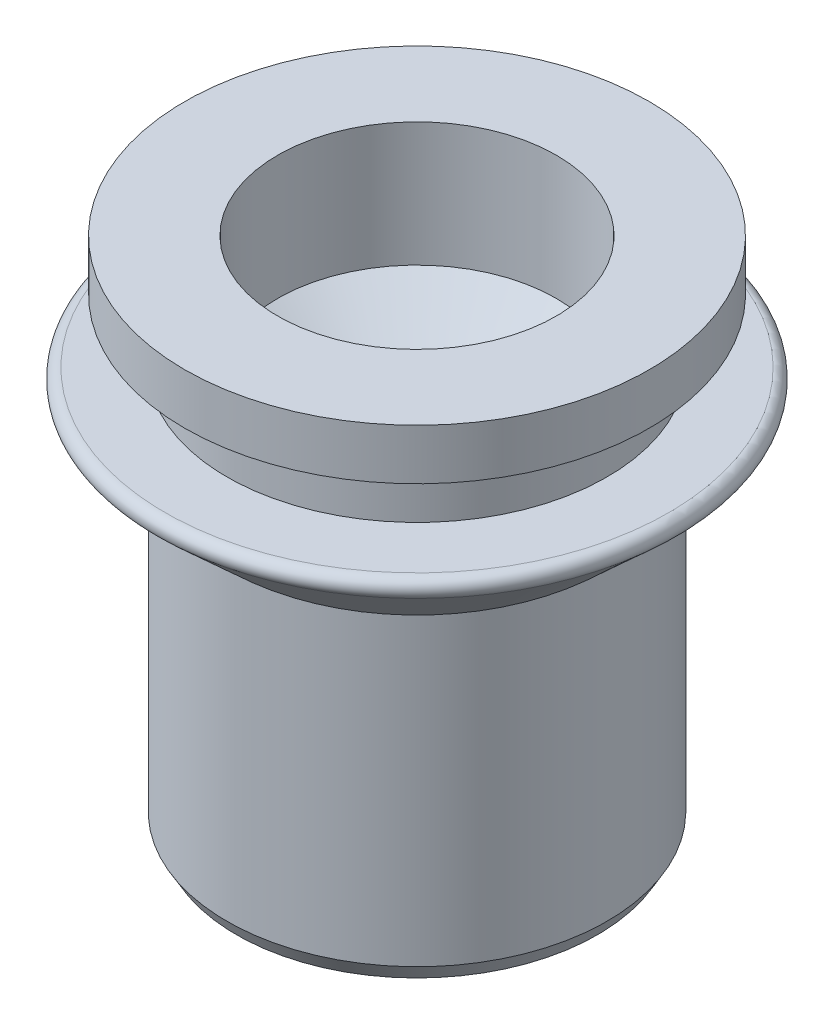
ISO-10303-21;
HEADER;
FILE_DESCRIPTION(('STEP AP214'),'2;1');
FILE_NAME('part.step','',(''),(''),'','','');
FILE_SCHEMA(('AUTOMOTIVE_DESIGN { 1 0 10303 214 1 1 1 1 }'));
ENDSEC;
DATA;
#1=APPLICATION_CONTEXT('core data for automotive mechanical design processes');
#2=APPLICATION_PROTOCOL_DEFINITION('international standard','automotive_design',2000,#1);
#3=PRODUCT_CONTEXT('',#1,'mechanical');
#4=PRODUCT('Part','Part','',(#3));
#5=PRODUCT_RELATED_PRODUCT_CATEGORY('part','',(#4));
#6=PRODUCT_DEFINITION_FORMATION('','',#4);
#7=PRODUCT_DEFINITION_CONTEXT('part definition',#1,'design');
#8=PRODUCT_DEFINITION('design','',#6,#7);
#9=PRODUCT_DEFINITION_SHAPE('','',#8);
#10=(LENGTH_UNIT() NAMED_UNIT(*) SI_UNIT(.MILLI.,.METRE.));
#11=(NAMED_UNIT(*) PLANE_ANGLE_UNIT() SI_UNIT($,.RADIAN.));
#12=(NAMED_UNIT(*) SI_UNIT($,.STERADIAN.) SOLID_ANGLE_UNIT());
#13=UNCERTAINTY_MEASURE_WITH_UNIT(LENGTH_MEASURE(1.E-05),#10,'distance_accuracy_value','');
#14=(GEOMETRIC_REPRESENTATION_CONTEXT(3) GLOBAL_UNCERTAINTY_ASSIGNED_CONTEXT((#13)) GLOBAL_UNIT_ASSIGNED_CONTEXT((#10,
#11,#12)) REPRESENTATION_CONTEXT('',''));
#15=CARTESIAN_POINT('',(0.,0.,0.));
#16=DIRECTION('',(0.,0.,1.));
#17=DIRECTION('',(1.,0.,0.));
#18=AXIS2_PLACEMENT_3D('',#15,#16,#17);
#19=CARTESIAN_POINT('',(0.,12.2,0.));
#20=DIRECTION('',(0.,-1.,0.));
#21=DIRECTION('',(0.,0.,-1.));
#22=AXIS2_PLACEMENT_3D('',#19,#20,#21);
#23=PLANE('',#22);
#24=CARTESIAN_POINT('',(0.,12.2,0.));
#25=DIRECTION('',(0.,-1.,0.));
#26=DIRECTION('',(0.,0.,-1.));
#27=AXIS2_PLACEMENT_3D('',#24,#25,#26);
#28=CIRCLE('',#27,5.5);
#29=CARTESIAN_POINT('',(0.,12.2,-5.49999999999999));
#30=VERTEX_POINT('',#29);
#31=EDGE_CURVE('E73',#30,#30,#28,.T.);
#32=ORIENTED_EDGE('',*,*,#31,.F.);
#33=EDGE_LOOP('',(#32));
#34=FACE_BOUND('',#33,.T.);
#35=CARTESIAN_POINT('',(0.,12.2,0.));
#36=DIRECTION('',(0.,-1.,0.));
#37=DIRECTION('',(0.,0.,-1.));
#38=AXIS2_PLACEMENT_3D('',#35,#36,#37);
#39=CIRCLE('',#38,3.3);
#40=CARTESIAN_POINT('',(0.,12.2,-3.29999999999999));
#41=VERTEX_POINT('',#40);
#42=EDGE_CURVE('E26',#41,#41,#39,.F.);
#43=ORIENTED_EDGE('',*,*,#42,.F.);
#44=EDGE_LOOP('',(#43));
#45=FACE_BOUND('',#44,.T.);
#46=ADVANCED_FACE('F22',(#34,#45),#23,.F.);
#47=CARTESIAN_POINT('',(0.,-0.999999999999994,0.));
#48=DIRECTION('',(0.,-1.,0.));
#49=DIRECTION('',(0.,0.,1.));
#50=AXIS2_PLACEMENT_3D('',#47,#48,#49);
#51=CYLINDRICAL_SURFACE('',#50,2.45875);
#52=CARTESIAN_POINT('',(0.,0.541250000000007,0.));
#53=DIRECTION('',(0.,-1.,0.));
#54=DIRECTION('',(0.,0.,1.));
#55=AXIS2_PLACEMENT_3D('',#52,#53,#54);
#56=CIRCLE('',#55,2.45875);
#57=CARTESIAN_POINT('',(0.,0.541250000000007,2.45875000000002));
#58=VERTEX_POINT('',#57);
#59=EDGE_CURVE('E70',#58,#58,#56,.T.);
#60=ORIENTED_EDGE('',*,*,#59,.T.);
#61=EDGE_LOOP('',(#60));
#62=FACE_BOUND('',#61,.T.);
#63=CARTESIAN_POINT('',(0.,6.85553820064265,0.));
#64=DIRECTION('',(0.,1.,0.));
#65=DIRECTION('',(0.,0.,1.));
#66=AXIS2_PLACEMENT_3D('',#63,#64,#65);
#67=CIRCLE('',#66,2.45875);
#68=CARTESIAN_POINT('',(0.,6.85553820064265,2.45875000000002));
#69=VERTEX_POINT('',#68);
#70=EDGE_CURVE('E44',#69,#69,#67,.T.);
#71=ORIENTED_EDGE('',*,*,#70,.T.);
#72=EDGE_LOOP('',(#71));
#73=FACE_BOUND('',#72,.T.);
#74=ADVANCED_FACE('F124',(#62,#73),#51,.F.);
#75=CARTESIAN_POINT('',(0.,0.,0.));
#76=DIRECTION('',(0.,-1.,0.));
#77=DIRECTION('',(0.,0.,-1.));
#78=AXIS2_PLACEMENT_3D('',#75,#76,#77);
#79=PLANE('',#78);
#80=CARTESIAN_POINT('',(0.,0.,0.));
#81=DIRECTION('',(0.,-1.,0.));
#82=DIRECTION('',(0.,0.,-1.));
#83=AXIS2_PLACEMENT_3D('',#80,#81,#82);
#84=CIRCLE('',#83,4.275);
#85=CARTESIAN_POINT('',(0.,0.,-4.275));
#86=VERTEX_POINT('',#85);
#87=EDGE_CURVE('E12',#86,#86,#84,.T.);
#88=ORIENTED_EDGE('',*,*,#87,.T.);
#89=EDGE_LOOP('',(#88));
#90=FACE_BOUND('',#89,.T.);
#91=CARTESIAN_POINT('',(0.,0.,0.));
#92=DIRECTION('',(0.,-1.,0.));
#93=DIRECTION('',(0.,0.,1.));
#94=AXIS2_PLACEMENT_3D('',#91,#92,#93);
#95=CIRCLE('',#94,3.);
#96=CARTESIAN_POINT('',(0.,0.,3.));
#97=VERTEX_POINT('',#96);
#98=EDGE_CURVE('E54',#97,#97,#95,.T.);
#99=ORIENTED_EDGE('',*,*,#98,.F.);
#100=EDGE_LOOP('',(#99));
#101=FACE_BOUND('',#100,.T.);
#102=ADVANCED_FACE('F24',(#90,#101),#79,.T.);
#103=CARTESIAN_POINT('',(0.,0.,0.));
#104=DIRECTION('',(0.,1.,0.));
#105=DIRECTION('',(0.,0.,1.));
#106=AXIS2_PLACEMENT_3D('',#103,#104,#105);
#107=CONICAL_SURFACE('',#106,4.275,0.523598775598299);
#108=CARTESIAN_POINT('',(0.,0.389711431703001,0.));
#109=DIRECTION('',(0.,-1.,0.));
#110=DIRECTION('',(0.,0.,-1.));
#111=AXIS2_PLACEMENT_3D('',#108,#109,#110);
#112=CIRCLE('',#111,4.5);
#113=CARTESIAN_POINT('',(0.,0.389711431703,-4.49999999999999));
#114=VERTEX_POINT('',#113);
#115=EDGE_CURVE('E31',#114,#114,#112,.T.);
#116=ORIENTED_EDGE('',*,*,#115,.T.);
#117=EDGE_LOOP('',(#116));
#118=FACE_BOUND('',#117,.T.);
#119=ORIENTED_EDGE('',*,*,#87,.F.);
#120=EDGE_LOOP('',(#119));
#121=FACE_BOUND('',#120,.T.);
#122=ADVANCED_FACE('F241',(#118,#121),#107,.T.);
#123=CARTESIAN_POINT('',(0.,0.,0.));
#124=DIRECTION('',(0.,-1.,0.));
#125=DIRECTION('',(0.,0.,-1.));
#126=AXIS2_PLACEMENT_3D('',#123,#124,#125);
#127=CYLINDRICAL_SURFACE('',#126,4.5);
#128=ORIENTED_EDGE('',*,*,#115,.F.);
#129=EDGE_LOOP('',(#128));
#130=FACE_BOUND('',#129,.T.);
#131=CARTESIAN_POINT('',(0.,7.60000000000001,0.));
#132=DIRECTION('',(0.,-1.,0.));
#133=DIRECTION('',(0.,0.,-1.));
#134=AXIS2_PLACEMENT_3D('',#131,#132,#133);
#135=CIRCLE('',#134,4.5);
#136=CARTESIAN_POINT('',(0.,7.60000000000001,-4.49999999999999));
#137=VERTEX_POINT('',#136);
#138=EDGE_CURVE('E41',#137,#137,#135,.T.);
#139=ORIENTED_EDGE('',*,*,#138,.T.);
#140=EDGE_LOOP('',(#139));
#141=FACE_BOUND('',#140,.T.);
#142=ADVANCED_FACE('F103',(#130,#141),#127,.T.);
#143=CARTESIAN_POINT('',(0.,9.09456213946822,0.));
#144=DIRECTION('',(0.,1.,0.));
#145=DIRECTION('',(0.,0.,1.));
#146=AXIS2_PLACEMENT_3D('',#143,#144,#145);
#147=CONICAL_SURFACE('',#146,6.13043786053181,0.828851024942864);
#148=ORIENTED_EDGE('',*,*,#138,.F.);
#149=EDGE_LOOP('',(#148));
#150=FACE_BOUND('',#149,.T.);
#151=CARTESIAN_POINT('',(0.,9.09456213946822,0.));
#152=DIRECTION('',(0.,-1.,0.));
#153=DIRECTION('',(0.,0.,-1.));
#154=AXIS2_PLACEMENT_3D('',#151,#152,#153);
#155=CIRCLE('',#154,6.13043786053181);
#156=CARTESIAN_POINT('',(0.,9.09456213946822,-6.1304378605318));
#157=VERTEX_POINT('',#156);
#158=EDGE_CURVE('E93',#157,#157,#155,.T.);
#159=ORIENTED_EDGE('',*,*,#158,.T.);
#160=EDGE_LOOP('',(#159));
#161=FACE_BOUND('',#160,.T.);
#162=ADVANCED_FACE('F105',(#150,#161),#147,.T.);
#163=CARTESIAN_POINT('',(0.,9.26250000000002,0.));
#164=DIRECTION('',(0.,-1.,0.));
#165=DIRECTION('',(0.,0.,-1.));
#166=AXIS2_PLACEMENT_3D('',#163,#164,#165);
#167=TOROIDAL_SURFACE('',#166,5.9625,0.2375);
#168=CARTESIAN_POINT('',(0.,9.50000000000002,0.));
#169=DIRECTION('',(0.,-1.,0.));
#170=DIRECTION('',(0.,0.,-1.));
#171=AXIS2_PLACEMENT_3D('',#168,#169,#170);
#172=CIRCLE('',#171,5.9625);
#173=CARTESIAN_POINT('',(0.,9.50000000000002,-5.96249999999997));
#174=VERTEX_POINT('',#173);
#175=EDGE_CURVE('E89',#174,#174,#172,.T.);
#176=ORIENTED_EDGE('',*,*,#175,.T.);
#177=EDGE_LOOP('',(#176));
#178=FACE_BOUND('',#177,.T.);
#179=ORIENTED_EDGE('',*,*,#158,.F.);
#180=EDGE_LOOP('',(#179));
#181=FACE_BOUND('',#180,.T.);
#182=ADVANCED_FACE('F108',(#178,#181),#167,.T.);
#183=CARTESIAN_POINT('',(4.5,9.50000000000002,0.));
#184=DIRECTION('',(0.,-1.,0.));
#185=DIRECTION('',(0.,0.,-1.));
#186=AXIS2_PLACEMENT_3D('',#183,#184,#185);
#187=PLANE('',#186);
#188=ORIENTED_EDGE('',*,*,#175,.F.);
#189=EDGE_LOOP('',(#188));
#190=FACE_BOUND('',#189,.T.);
#191=CARTESIAN_POINT('',(0.,9.50000000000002,0.));
#192=DIRECTION('',(0.,-1.,0.));
#193=DIRECTION('',(0.,0.,-1.));
#194=AXIS2_PLACEMENT_3D('',#191,#192,#193);
#195=CIRCLE('',#194,4.5);
#196=CARTESIAN_POINT('',(0.,9.50000000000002,-4.49999999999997));
#197=VERTEX_POINT('',#196);
#198=EDGE_CURVE('E85',#197,#197,#195,.T.);
#199=ORIENTED_EDGE('',*,*,#198,.T.);
#200=EDGE_LOOP('',(#199));
#201=FACE_BOUND('',#200,.T.);
#202=ADVANCED_FACE('F113',(#190,#201),#187,.F.);
#203=CARTESIAN_POINT('',(0.,0.,0.));
#204=DIRECTION('',(0.,-1.,0.));
#205=DIRECTION('',(0.,0.,-1.));
#206=AXIS2_PLACEMENT_3D('',#203,#204,#205);
#207=CYLINDRICAL_SURFACE('',#206,4.5);
#208=ORIENTED_EDGE('',*,*,#198,.F.);
#209=EDGE_LOOP('',(#208));
#210=FACE_BOUND('',#209,.T.);
#211=CARTESIAN_POINT('',(0.,11.,0.));
#212=DIRECTION('',(0.,-1.,0.));
#213=DIRECTION('',(0.,0.,-1.));
#214=AXIS2_PLACEMENT_3D('',#211,#212,#213);
#215=CIRCLE('',#214,4.5);
#216=CARTESIAN_POINT('',(0.,11.,-4.5));
#217=VERTEX_POINT('',#216);
#218=EDGE_CURVE('E81',#217,#217,#215,.T.);
#219=ORIENTED_EDGE('',*,*,#218,.T.);
#220=EDGE_LOOP('',(#219));
#221=FACE_BOUND('',#220,.T.);
#222=ADVANCED_FACE('F120',(#210,#221),#207,.T.);
#223=CARTESIAN_POINT('',(4.5,11.,0.));
#224=DIRECTION('',(0.,-1.,0.));
#225=DIRECTION('',(0.,0.,-1.));
#226=AXIS2_PLACEMENT_3D('',#223,#224,#225);
#227=PLANE('',#226);
#228=CARTESIAN_POINT('',(0.,11.,0.));
#229=DIRECTION('',(0.,-1.,0.));
#230=DIRECTION('',(0.,0.,-1.));
#231=AXIS2_PLACEMENT_3D('',#228,#229,#230);
#232=CIRCLE('',#231,5.5);
#233=CARTESIAN_POINT('',(0.,11.,-5.5));
#234=VERTEX_POINT('',#233);
#235=EDGE_CURVE('E77',#234,#234,#232,.T.);
#236=ORIENTED_EDGE('',*,*,#235,.T.);
#237=EDGE_LOOP('',(#236));
#238=FACE_BOUND('',#237,.T.);
#239=ORIENTED_EDGE('',*,*,#218,.F.);
#240=EDGE_LOOP('',(#239));
#241=FACE_BOUND('',#240,.T.);
#242=ADVANCED_FACE('F140',(#238,#241),#227,.T.);
#243=CARTESIAN_POINT('',(0.,0.,0.));
#244=DIRECTION('',(0.,-1.,0.));
#245=DIRECTION('',(0.,0.,-1.));
#246=AXIS2_PLACEMENT_3D('',#243,#244,#245);
#247=CYLINDRICAL_SURFACE('',#246,5.5);
#248=ORIENTED_EDGE('',*,*,#235,.F.);
#249=EDGE_LOOP('',(#248));
#250=FACE_BOUND('',#249,.T.);
#251=ORIENTED_EDGE('',*,*,#31,.T.);
#252=EDGE_LOOP('',(#251));
#253=FACE_BOUND('',#252,.T.);
#254=ADVANCED_FACE('F136',(#250,#253),#247,.T.);
#255=CARTESIAN_POINT('',(0.,0.541250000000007,0.));
#256=DIRECTION('',(0.,-1.,0.));
#257=DIRECTION('',(0.,0.,1.));
#258=AXIS2_PLACEMENT_3D('',#255,#256,#257);
#259=CONICAL_SURFACE('',#258,2.45875,0.785398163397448);
#260=ORIENTED_EDGE('',*,*,#98,.T.);
#261=EDGE_LOOP('',(#260));
#262=FACE_BOUND('',#261,.T.);
#263=ORIENTED_EDGE('',*,*,#59,.F.);
#264=EDGE_LOOP('',(#263));
#265=FACE_BOUND('',#264,.T.);
#266=ADVANCED_FACE('F139',(#262,#265),#259,.F.);
#267=CARTESIAN_POINT('',(0.,0.,0.));
#268=DIRECTION('',(0.,-1.,0.));
#269=DIRECTION('',(0.,0.,-1.));
#270=AXIS2_PLACEMENT_3D('',#267,#268,#269);
#271=CYLINDRICAL_SURFACE('',#270,3.3);
#272=CARTESIAN_POINT('',(0.,9.26250000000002,0.));
#273=DIRECTION('',(0.,-1.,0.));
#274=DIRECTION('',(0.,0.,-1.));
#275=AXIS2_PLACEMENT_3D('',#272,#273,#274);
#276=CIRCLE('',#275,3.3);
#277=CARTESIAN_POINT('',(0.,9.26250000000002,-3.29999999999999));
#278=VERTEX_POINT('',#277);
#279=EDGE_CURVE('E57',#278,#278,#276,.T.);
#280=ORIENTED_EDGE('',*,*,#279,.T.);
#281=EDGE_LOOP('',(#280));
#282=FACE_BOUND('',#281,.T.);
#283=ORIENTED_EDGE('',*,*,#42,.T.);
#284=EDGE_LOOP('',(#283));
#285=FACE_BOUND('',#284,.T.);
#286=ADVANCED_FACE('F175',(#282,#285),#271,.F.);
#287=CARTESIAN_POINT('',(0.,9.26250000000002,0.));
#288=DIRECTION('',(0.,1.,0.));
#289=DIRECTION('',(0.,0.,1.));
#290=AXIS2_PLACEMENT_3D('',#287,#288,#289);
#291=CONICAL_SURFACE('',#290,5.58,0.913894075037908);
#292=ORIENTED_EDGE('',*,*,#70,.F.);
#293=EDGE_LOOP('',(#292));
#294=FACE_BOUND('',#293,.T.);
#295=CARTESIAN_POINT('',(0.,9.26250000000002,0.));
#296=DIRECTION('',(0.,-1.,0.));
#297=DIRECTION('',(0.,0.,-1.));
#298=AXIS2_PLACEMENT_3D('',#295,#296,#297);
#299=CIRCLE('',#298,5.58);
#300=CARTESIAN_POINT('',(0.,9.26250000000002,-5.57999999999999));
#301=VERTEX_POINT('',#300);
#302=EDGE_CURVE('E47',#301,#301,#299,.T.);
#303=ORIENTED_EDGE('',*,*,#302,.F.);
#304=EDGE_LOOP('',(#303));
#305=FACE_BOUND('',#304,.T.);
#306=ADVANCED_FACE('F183',(#294,#305),#291,.F.);
#307=CARTESIAN_POINT('',(3.3,9.26250000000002,0.));
#308=DIRECTION('',(0.,-1.,0.));
#309=DIRECTION('',(0.,0.,-1.));
#310=AXIS2_PLACEMENT_3D('',#307,#308,#309);
#311=PLANE('',#310);
#312=ORIENTED_EDGE('',*,*,#302,.T.);
#313=EDGE_LOOP('',(#312));
#314=FACE_BOUND('',#313,.T.);
#315=ORIENTED_EDGE('',*,*,#279,.F.);
#316=EDGE_LOOP('',(#315));
#317=FACE_BOUND('',#316,.T.);
#318=ADVANCED_FACE('F192',(#314,#317),#311,.T.);
#319=CLOSED_SHELL('',(#46,#74,#102,#122,#142,#162,#182,#202,#222,#242,#254,#266,#286,#306,#318));
#320=MANIFOLD_SOLID_BREP('B1',#319);
#321=ADVANCED_BREP_SHAPE_REPRESENTATION('',(#18,#320),#14);
#322=SHAPE_DEFINITION_REPRESENTATION(#9,#321);
ENDSEC;
END-ISO-10303-21;
